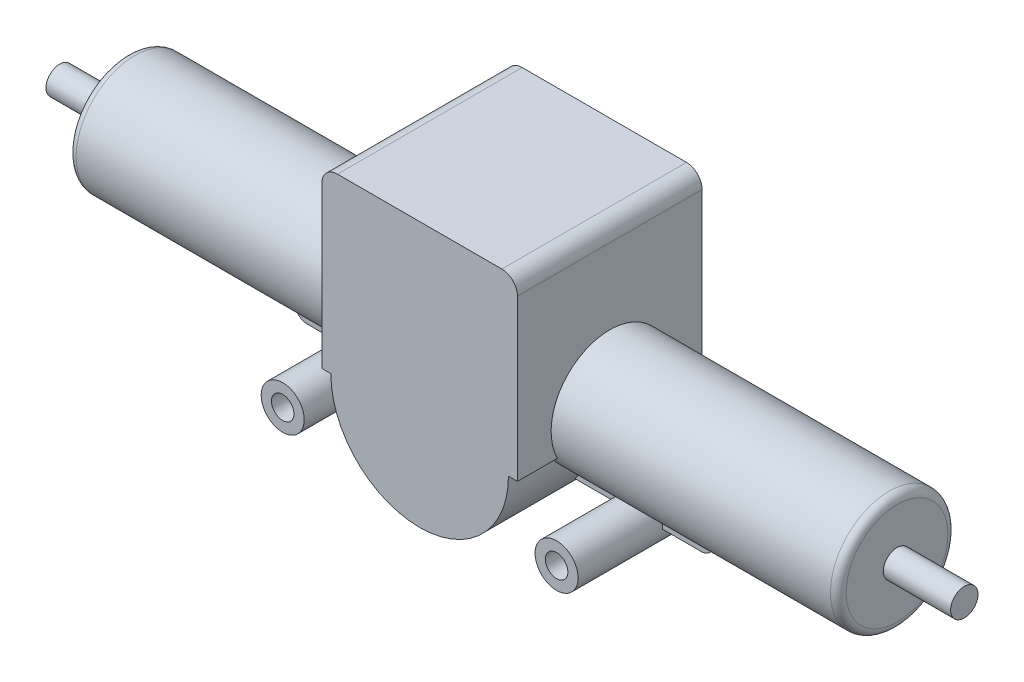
from build123d import *

# Parameters (mm, degrees)
BOSS_EXTRUDE1_DEPTH   = 14.986
SKETCH2_R             = 9.525
BOSS_EXTRUDE2_DEPTH   = 62.484
FILLET1_R             = 1.27
BOSS_EXTRUDE6_DEPTH   = 1.27
F_6_CLEARANCE_HOLE1_D = 3.6576
SKETCH6_R             = 3.4925
SKETCH6_R_2           = 1.8288
BOSS_EXTRUDE7_DEPTH   = 13.716
SKETCH7_R             = 2.2225
BOSS_EXTRUDE8_DEPTH   = 10.922


with BuildPart() as part:
    # Sketch1 → Boss-Extrude1 (new, symmetric)
    with BuildSketch(Plane.XY):
        with BuildLine():
            Line((14.4145, -4.288154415), (15.875, -4.288154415))
            Line((15.875, -4.288154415), (15.875, 21.746845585))
            ThreePointArc((15.875, 21.746845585), (15.131051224, 23.542896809), (13.335, 24.286845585))
            Line((13.335, 24.286845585), (-13.335, 24.286845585))
            ThreePointArc((-13.335, 24.286845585), (-15.131051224, 23.542896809), (-15.875, 21.746845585))
            Line((-15.875, 21.746845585), (-15.875, -4.288154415))
            Line((-15.875, -4.288154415), (-14.4145, -4.288154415))
            ThreePointArc((-14.4145, -4.288154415), (0, -18.702654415), (14.4145, -4.288154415))
        make_face()
    extrude(amount=BOSS_EXTRUDE1_DEPTH, both=True)

    # Sketch2 → Boss-Extrude2 (add, symmetric)
    with BuildSketch(Plane(origin=(0, 0, 0), x_dir=(0, 0, -1), z_dir=(1, 0, 0))):
        with Locations(Location((0, 0, 0), (0, 0, 206.756512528))):
            Circle(SKETCH2_R)
    extrude(amount=BOSS_EXTRUDE2_DEPTH, both=True)

    # Fillet1
    fillet1_edges = [part.edges().sort_by_distance(p)[0] for p in [
        (-62.484, 4.288154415, -8.505137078),
        (62.484, 4.288154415, -8.505137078),
    ]]
    fillet(fillet1_edges, radius=FILLET1_R)

    # Sketch3 → Boss-Extrude6 (add, symmetric)
    with BuildSketch(Plane.XY):
        with BuildLine():
            Line((-33.909, -7.119741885), (33.909, -7.119741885))
            Line((33.909, -7.119741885), (33.909, -11.049))
            ThreePointArc((33.909, -11.049), (33.351038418, -12.396038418), (32.004, -12.954))
            Line((32.004, -12.954), (25.7175, -12.954))
            ThreePointArc((25.7175, -12.954), (22.225, -16.4465), (18.7325, -12.954))
            Line((18.7325, -12.954), (-18.7325, -12.954))
            ThreePointArc((-18.7325, -12.954), (-22.225, -16.4465), (-25.7175, -12.954))
            Line((-25.7175, -12.954), (-32.004, -12.954))
            ThreePointArc((-32.004, -12.954), (-33.351038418, -12.396038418), (-33.909, -11.049))
            Line((-33.909, -11.049), (-33.909, -7.119741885))
        make_face()
    extrude(amount=BOSS_EXTRUDE6_DEPTH, both=True)

    # 6 Clearance Hole1 (through all)
    with Locations(Plane.XY.offset(1.27)):
        with Locations((-22.225, -12.954), (22.225, -12.954)):
            Hole(F_6_CLEARANCE_HOLE1_D / 2)

    # Sketch6 → Boss-Extrude7 (add)
    # profile 1 of 2: a face of its own
    with BuildSketch(Plane.XY.offset(1.27)):
        with Locations(Location((-22.225, -12.954, 0), (0, 0, 180))):
            Circle(SKETCH6_R)
        with Locations((-22.225, -12.954)):
            Circle(SKETCH6_R_2, mode=Mode.SUBTRACT)
    # profile 2 of 2: a face of its own
    with BuildSketch(Plane.XY.offset(1.27)):
        with Locations(Location((22.225, -12.954, 0), (0, 0, 180))):
            Circle(SKETCH6_R)
        with Locations((22.225, -12.954)):
            Circle(SKETCH6_R_2, mode=Mode.SUBTRACT)
    extrude(amount=BOSS_EXTRUDE7_DEPTH)

    # Sketch7 → Boss-Extrude8 (add)
    with BuildSketch(Plane.ZY.offset(62.484)):
        with Locations(Location((0, 0, 0), (0, 0, 180))):
            Circle(SKETCH7_R)
    boss_extrude8 = extrude(amount=BOSS_EXTRUDE8_DEPTH)

    # Mirror2: Boss-Extrude8 across plane
    add(boss_extrude8.mirror(Plane(origin=(0, 0, 0), x_dir=(0, 0, 1), z_dir=(1, 0, 0))))


solid = part.part
